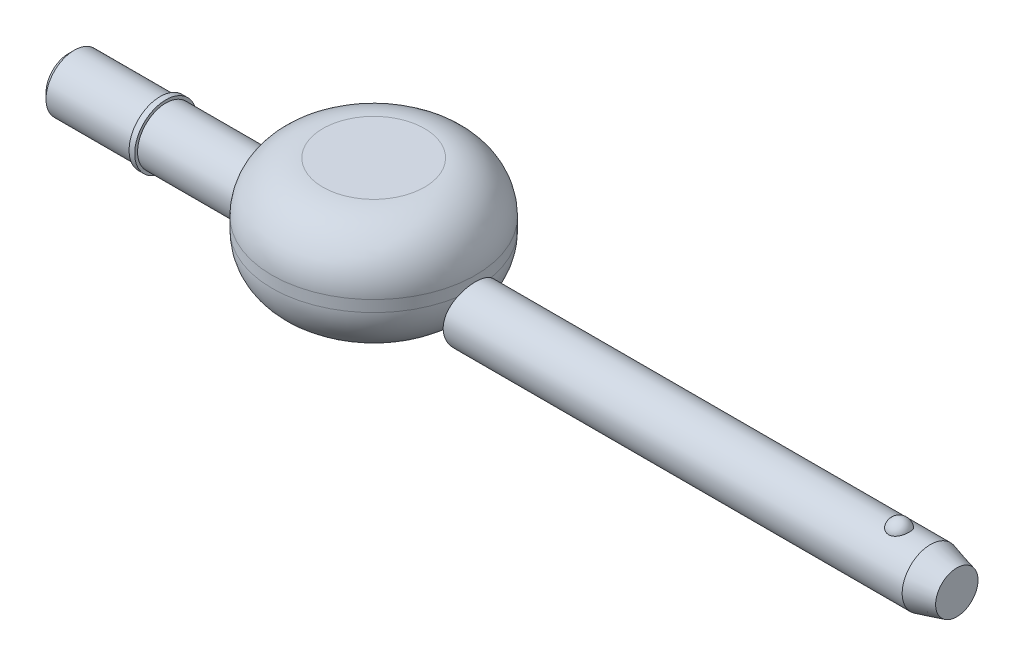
ISO-10303-21;
HEADER;
FILE_DESCRIPTION(('STEP AP214'),'2;1');
FILE_NAME('part.step','',(''),(''),'','','');
FILE_SCHEMA(('AUTOMOTIVE_DESIGN { 1 0 10303 214 1 1 1 1 }'));
ENDSEC;
DATA;
#1=APPLICATION_CONTEXT('core data for automotive mechanical design processes');
#2=APPLICATION_PROTOCOL_DEFINITION('international standard','automotive_design',2000,#1);
#3=PRODUCT_CONTEXT('',#1,'mechanical');
#4=PRODUCT('Part','Part','',(#3));
#5=PRODUCT_RELATED_PRODUCT_CATEGORY('part','',(#4));
#6=PRODUCT_DEFINITION_FORMATION('','',#4);
#7=PRODUCT_DEFINITION_CONTEXT('part definition',#1,'design');
#8=PRODUCT_DEFINITION('design','',#6,#7);
#9=PRODUCT_DEFINITION_SHAPE('','',#8);
#10=(LENGTH_UNIT() NAMED_UNIT(*) SI_UNIT(.MILLI.,.METRE.));
#11=(NAMED_UNIT(*) PLANE_ANGLE_UNIT() SI_UNIT($,.RADIAN.));
#12=(NAMED_UNIT(*) SI_UNIT($,.STERADIAN.) SOLID_ANGLE_UNIT());
#13=UNCERTAINTY_MEASURE_WITH_UNIT(LENGTH_MEASURE(1.E-05),#10,'distance_accuracy_value','');
#14=(GEOMETRIC_REPRESENTATION_CONTEXT(3) GLOBAL_UNCERTAINTY_ASSIGNED_CONTEXT((#13)) GLOBAL_UNIT_ASSIGNED_CONTEXT((#10,
#11,#12)) REPRESENTATION_CONTEXT('',''));
#15=CARTESIAN_POINT('',(0.,0.,0.));
#16=DIRECTION('',(0.,0.,1.));
#17=DIRECTION('',(1.,0.,0.));
#18=AXIS2_PLACEMENT_3D('',#15,#16,#17);
#19=CARTESIAN_POINT('',(85.725,23.81,0.));
#20=DIRECTION('',(0.,-1.,0.));
#21=DIRECTION('',(0.,0.,-1.));
#22=AXIS2_PLACEMENT_3D('',#19,#20,#21);
#23=CYLINDRICAL_SURFACE('',#22,28.575);
#24=CARTESIAN_POINT('',(85.725,6.3475,0.));
#25=DIRECTION('',(0.,1.,0.));
#26=DIRECTION('',(0.,0.,1.));
#27=AXIS2_PLACEMENT_3D('',#24,#25,#26);
#28=CIRCLE('',#27,28.575);
#29=CARTESIAN_POINT('',(85.725,6.3475,28.575));
#30=VERTEX_POINT('',#29);
#31=EDGE_CURVE('P0_E25',#30,#30,#28,.T.);
#32=ORIENTED_EDGE('',*,*,#31,.T.);
#33=EDGE_LOOP('',(#32));
#34=FACE_BOUND('',#33,.T.);
#35=CARTESIAN_POINT('',(85.725,9.5225,0.));
#36=DIRECTION('',(0.,1.,0.));
#37=DIRECTION('',(0.,0.,1.));
#38=AXIS2_PLACEMENT_3D('',#35,#36,#37);
#39=CIRCLE('',#38,28.575);
#40=CARTESIAN_POINT('',(85.725,9.5225,28.575));
#41=VERTEX_POINT('',#40);
#42=EDGE_CURVE('P0_E29',#41,#41,#39,.F.);
#43=ORIENTED_EDGE('',*,*,#42,.T.);
#44=EDGE_LOOP('',(#43));
#45=FACE_BOUND('',#44,.T.);
#46=ADVANCED_FACE('P0_F14',(#34,#45),#23,.T.);
#47=CARTESIAN_POINT('',(85.725,23.81,0.));
#48=DIRECTION('',(0.,1.,0.));
#49=DIRECTION('',(0.,0.,1.));
#50=AXIS2_PLACEMENT_3D('',#47,#48,#49);
#51=PLANE('',#50);
#52=CARTESIAN_POINT('',(85.725,23.81,0.));
#53=DIRECTION('',(0.,1.,0.));
#54=DIRECTION('',(0.,0.,1.));
#55=AXIS2_PLACEMENT_3D('',#52,#53,#54);
#56=CIRCLE('',#55,14.2875);
#57=CARTESIAN_POINT('',(85.725,23.81,14.2875));
#58=VERTEX_POINT('',#57);
#59=EDGE_CURVE('P0_E10',#58,#58,#56,.T.);
#60=ORIENTED_EDGE('',*,*,#59,.T.);
#61=EDGE_LOOP('',(#60));
#62=FACE_BOUND('',#61,.T.);
#63=ADVANCED_FACE('P0_F46',(#62),#51,.T.);
#64=CARTESIAN_POINT('',(85.725,-7.94,0.));
#65=DIRECTION('',(0.,1.,0.));
#66=DIRECTION('',(0.,0.,1.));
#67=AXIS2_PLACEMENT_3D('',#64,#65,#66);
#68=PLANE('',#67);
#69=CARTESIAN_POINT('',(85.725,-7.94,0.));
#70=DIRECTION('',(0.,1.,0.));
#71=DIRECTION('',(0.,0.,1.));
#72=AXIS2_PLACEMENT_3D('',#69,#70,#71);
#73=CIRCLE('',#72,14.2875);
#74=CARTESIAN_POINT('',(85.725,-7.94,14.2875));
#75=VERTEX_POINT('',#74);
#76=EDGE_CURVE('P0_E21',#75,#75,#73,.F.);
#77=ORIENTED_EDGE('',*,*,#76,.T.);
#78=EDGE_LOOP('',(#77));
#79=FACE_BOUND('',#78,.T.);
#80=ADVANCED_FACE('P0_F43',(#79),#68,.F.);
#81=CARTESIAN_POINT('',(85.725,6.3475,0.));
#82=DIRECTION('',(0.,1.,0.));
#83=DIRECTION('',(0.,0.,1.));
#84=AXIS2_PLACEMENT_3D('',#81,#82,#83);
#85=TOROIDAL_SURFACE('',#84,14.2875,14.2875);
#86=ORIENTED_EDGE('',*,*,#76,.F.);
#87=EDGE_LOOP('',(#86));
#88=FACE_BOUND('',#87,.T.);
#89=ORIENTED_EDGE('',*,*,#31,.F.);
#90=EDGE_LOOP('',(#89));
#91=FACE_BOUND('',#90,.T.);
#92=ADVANCED_FACE('P0_F38',(#88,#91),#85,.T.);
#93=CARTESIAN_POINT('',(85.725,9.5225,0.));
#94=DIRECTION('',(0.,1.,0.));
#95=DIRECTION('',(0.,0.,1.));
#96=AXIS2_PLACEMENT_3D('',#93,#94,#95);
#97=TOROIDAL_SURFACE('',#96,14.2875,14.2875);
#98=ORIENTED_EDGE('',*,*,#42,.F.);
#99=EDGE_LOOP('',(#98));
#100=FACE_BOUND('',#99,.T.);
#101=ORIENTED_EDGE('',*,*,#59,.F.);
#102=EDGE_LOOP('',(#101));
#103=FACE_BOUND('',#102,.T.);
#104=ADVANCED_FACE('P0_F16',(#100,#103),#97,.T.);
#105=CLOSED_SHELL('',(#46,#63,#80,#92,#104));
#106=MANIFOLD_SOLID_BREP('P0_B1',#105);
#107=CARTESIAN_POINT('',(0.,0.,0.));
#108=DIRECTION('',(1.,0.,0.));
#109=DIRECTION('',(0.,0.,-1.));
#110=AXIS2_PLACEMENT_3D('',#107,#108,#109);
#111=CYLINDRICAL_SURFACE('',#110,7.94);
#112=CARTESIAN_POINT('',(58.2752818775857,0.,-7.94));
#113=CARTESIAN_POINT('',(58.2752814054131,0.218339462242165,-7.9399993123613));
#114=CARTESIAN_POINT('',(58.2726697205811,0.436691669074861,-7.93098628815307));
#115=CARTESIAN_POINT('',(58.2623027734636,0.871798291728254,-7.89501301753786));
#116=CARTESIAN_POINT('',(58.2545471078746,1.08855258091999,-7.86805136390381));
#117=CARTESIAN_POINT('',(58.2341298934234,1.51892239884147,-7.79641397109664));
#118=CARTESIAN_POINT('',(58.2214673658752,1.73253729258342,-7.75173469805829));
#119=CARTESIAN_POINT('',(58.1916160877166,2.15514620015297,-7.64502850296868));
#120=CARTESIAN_POINT('',(58.1744256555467,2.36413846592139,-7.58299513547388));
#121=CARTESIAN_POINT('',(58.1360696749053,2.77559648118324,-7.44223447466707));
#122=CARTESIAN_POINT('',(58.1149117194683,2.97807384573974,-7.3635390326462));
#123=CARTESIAN_POINT('',(58.0692035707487,3.37565834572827,-7.18996526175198));
#124=CARTESIAN_POINT('',(58.044652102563,3.57076267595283,-7.09508084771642));
#125=CARTESIAN_POINT('',(57.9928646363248,3.9522155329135,-6.88988246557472));
#126=CARTESIAN_POINT('',(57.9656295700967,4.13856706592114,-6.77957384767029));
#127=CARTESIAN_POINT('',(57.9092032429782,4.50152019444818,-6.54421285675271));
#128=CARTESIAN_POINT('',(57.8800110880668,4.678117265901,-6.41915372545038));
#129=CARTESIAN_POINT('',(57.8197338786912,5.02460676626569,-6.15190726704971));
#130=CARTESIAN_POINT('',(57.7886199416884,5.19422795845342,-6.00937467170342));
#131=CARTESIAN_POINT('',(57.7260481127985,5.52086699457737,-5.71074222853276));
#132=CARTESIAN_POINT('',(57.6945903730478,5.67789017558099,-5.55464818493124));
#133=CARTESIAN_POINT('',(57.6321603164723,5.9784820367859,-5.22975661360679));
#134=CARTESIAN_POINT('',(57.6011882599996,6.12204369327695,-5.06095253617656));
#135=CARTESIAN_POINT('',(57.5405992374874,6.39461301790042,-4.71185180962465));
#136=CARTESIAN_POINT('',(57.5109817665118,6.52362613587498,-4.53155950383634));
#137=CARTESIAN_POINT('',(57.4533811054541,6.76844317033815,-4.15724416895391));
#138=CARTESIAN_POINT('',(57.4254367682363,6.88396858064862,-3.96303283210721));
#139=CARTESIAN_POINT('',(57.3725736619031,7.09815651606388,-3.56521914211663));
#140=CARTESIAN_POINT('',(57.3476537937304,7.19682517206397,-3.36162023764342));
#141=CARTESIAN_POINT('',(57.3015387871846,7.37656233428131,-2.94637283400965));
#142=CARTESIAN_POINT('',(57.2803438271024,7.45762999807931,-2.73472395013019));
#143=CARTESIAN_POINT('',(57.2422944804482,7.60146722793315,-2.30491797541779));
#144=CARTESIAN_POINT('',(57.2254399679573,7.66423732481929,-2.08676107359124));
#145=CARTESIAN_POINT('',(57.1969227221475,7.76959948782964,-1.6510340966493));
#146=CARTESIAN_POINT('',(57.1851417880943,7.81265262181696,-1.43358319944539));
#147=CARTESIAN_POINT('',(57.1665098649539,7.88044407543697,-0.995638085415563));
#148=CARTESIAN_POINT('',(57.1596587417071,7.90518289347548,-0.775143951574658));
#149=CARTESIAN_POINT('',(57.1510817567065,7.93611996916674,-0.332792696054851));
#150=CARTESIAN_POINT('',(57.1493551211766,7.94232102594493,-0.110935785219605));
#151=CARTESIAN_POINT('',(57.1510743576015,7.93613326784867,0.332496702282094));
#152=CARTESIAN_POINT('',(57.154520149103,7.92374474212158,0.554072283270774));
#153=CARTESIAN_POINT('',(57.1663200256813,7.88109005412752,0.989182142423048));
#154=CARTESIAN_POINT('',(57.1745361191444,7.85132637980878,1.20276965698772));
#155=CARTESIAN_POINT('',(57.195548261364,7.77457094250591,1.62667072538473));
#156=CARTESIAN_POINT('',(57.2083458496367,7.72757338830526,1.83698315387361));
#157=CARTESIAN_POINT('',(57.238175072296,7.61675869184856,2.25274458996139));
#158=CARTESIAN_POINT('',(57.2552053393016,7.55294698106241,2.45819514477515));
#159=CARTESIAN_POINT('',(57.2930610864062,7.40897748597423,2.86300925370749));
#160=CARTESIAN_POINT('',(57.3138879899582,7.32881356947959,3.06237049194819));
#161=CARTESIAN_POINT('',(57.3590197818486,7.15186675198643,3.45562783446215));
#162=CARTESIAN_POINT('',(57.3833578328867,7.05492339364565,3.64944790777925));
#163=CARTESIAN_POINT('',(57.4347212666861,6.8456652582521,4.02831447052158));
#164=CARTESIAN_POINT('',(57.4617475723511,6.73334519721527,4.21335791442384));
#165=CARTESIAN_POINT('',(57.5177788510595,6.49413702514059,4.57345687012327));
#166=CARTESIAN_POINT('',(57.5467838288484,6.36724887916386,4.74851235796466));
#167=CARTESIAN_POINT('',(57.6060236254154,6.09973907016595,5.08757484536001));
#168=CARTESIAN_POINT('',(57.6362584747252,5.95911706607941,5.25158157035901));
#169=CARTESIAN_POINT('',(57.6981968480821,5.66010309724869,5.5728433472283));
#170=CARTESIAN_POINT('',(57.7299156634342,5.50127397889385,5.72968885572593));
#171=CARTESIAN_POINT('',(57.7929413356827,5.17099027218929,6.0294427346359));
#172=CARTESIAN_POINT('',(57.8242483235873,4.99953981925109,6.17235563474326));
#173=CARTESIAN_POINT('',(57.8855948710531,4.64499130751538,6.44340511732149));
#174=CARTESIAN_POINT('',(57.9156338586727,4.46188808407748,6.57153507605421));
#175=CARTESIAN_POINT('',(57.9735564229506,4.08536156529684,6.81199672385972));
#176=CARTESIAN_POINT('',(58.0014408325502,3.8919423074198,6.92433453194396));
#177=CARTESIAN_POINT('',(58.0544498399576,3.49448106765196,7.13323113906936));
#178=CARTESIAN_POINT('',(58.079551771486,3.2903693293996,7.22966308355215));
#179=CARTESIAN_POINT('',(58.1259709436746,2.87438293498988,7.40489292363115));
#180=CARTESIAN_POINT('',(58.1472896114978,2.66251124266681,7.48369747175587));
#181=CARTESIAN_POINT('',(58.1854824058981,2.23245765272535,7.6230453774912));
#182=CARTESIAN_POINT('',(58.2023566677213,2.01427594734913,7.68358929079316));
#183=CARTESIAN_POINT('',(58.2311160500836,1.57322655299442,7.78587177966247));
#184=CARTESIAN_POINT('',(58.2430013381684,1.35035902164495,7.82761098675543));
#185=CARTESIAN_POINT('',(58.2610949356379,0.908908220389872,7.89085474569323));
#186=CARTESIAN_POINT('',(58.2674742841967,0.690419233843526,7.91296959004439));
#187=CARTESIAN_POINT('',(58.2749964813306,0.252271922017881,7.93902502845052));
#188=CARTESIAN_POINT('',(58.2761394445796,0.0326136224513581,7.94296602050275));
#189=CARTESIAN_POINT('',(58.2731531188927,-0.406213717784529,7.93263862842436));
#190=CARTESIAN_POINT('',(58.2690243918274,-0.625382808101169,7.91837218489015));
#191=CARTESIAN_POINT('',(58.2556252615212,-1.06162955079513,7.8717636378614));
#192=CARTESIAN_POINT('',(58.2463548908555,-1.27870721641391,7.83942164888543));
#193=CARTESIAN_POINT('',(58.2232133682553,-1.70454527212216,7.75784178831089));
#194=CARTESIAN_POINT('',(58.2094456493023,-1.91338409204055,7.70898297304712));
#195=CARTESIAN_POINT('',(58.1776617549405,-2.32619619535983,7.5946231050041));
#196=CARTESIAN_POINT('',(58.1596441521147,-2.53016781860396,7.52911646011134));
#197=CARTESIAN_POINT('',(58.1198836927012,-2.93178218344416,7.38200362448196));
#198=CARTESIAN_POINT('',(58.0981417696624,-3.12942649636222,7.30040146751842));
#199=CARTESIAN_POINT('',(58.051527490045,-3.5172629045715,7.12166218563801));
#200=CARTESIAN_POINT('',(58.0266539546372,-3.70745215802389,7.02451920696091));
#201=CARTESIAN_POINT('',(57.9738518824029,-4.08346058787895,6.81296983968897));
#202=CARTESIAN_POINT('',(57.9458657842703,-4.26907550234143,6.69821473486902));
#203=CARTESIAN_POINT('',(57.8880971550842,-4.63010863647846,6.45393040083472));
#204=CARTESIAN_POINT('',(57.8583140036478,-4.80552329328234,6.32439605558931));
#205=CARTESIAN_POINT('',(57.7977682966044,-5.14501198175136,6.05143715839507));
#206=CARTESIAN_POINT('',(57.7670057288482,-5.30908587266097,5.90801243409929));
#207=CARTESIAN_POINT('',(57.7053225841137,-5.62488081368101,5.60818366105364));
#208=CARTESIAN_POINT('',(57.6744020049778,-5.77660169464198,5.45177943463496));
#209=CARTESIAN_POINT('',(57.6122412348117,-6.07137549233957,5.12176702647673));
#210=CARTESIAN_POINT('',(57.5810223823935,-6.2139967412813,4.94776889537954));
#211=CARTESIAN_POINT('',(57.5201700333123,-6.48403523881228,4.58818327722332));
#212=CARTESIAN_POINT('',(57.4905359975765,-6.61145767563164,4.40259977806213));
#213=CARTESIAN_POINT('',(57.4336614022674,-6.85027548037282,4.02094700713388));
#214=CARTESIAN_POINT('',(57.4064216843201,-6.96166522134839,3.82487408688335));
#215=CARTESIAN_POINT('',(57.3551269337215,-7.16746851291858,3.42371059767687));
#216=CARTESIAN_POINT('',(57.3310706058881,-7.26188897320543,3.21862374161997));
#217=CARTESIAN_POINT('',(57.2869776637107,-7.43241733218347,2.80232011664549));
#218=CARTESIAN_POINT('',(57.2669129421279,-7.50865408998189,2.59115913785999));
#219=CARTESIAN_POINT('',(57.231163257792,-7.64302979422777,2.16287867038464));
#220=CARTESIAN_POINT('',(57.2154766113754,-7.70117569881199,1.9457615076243));
#221=CARTESIAN_POINT('',(57.1889252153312,-7.79889433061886,1.50709659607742));
#222=CARTESIAN_POINT('',(57.1780604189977,-7.83846723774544,1.28554889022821));
#223=CARTESIAN_POINT('',(57.1614695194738,-7.89867642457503,0.83970623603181));
#224=CARTESIAN_POINT('',(57.1557432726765,-7.91931323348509,0.615411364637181));
#225=CARTESIAN_POINT('',(57.1496987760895,-7.94109041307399,0.173291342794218));
#226=CARTESIAN_POINT('',(57.1492069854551,-7.94285642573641,-0.0445008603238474));
#227=CARTESIAN_POINT('',(57.1531948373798,-7.92849756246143,-0.479448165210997));
#228=CARTESIAN_POINT('',(57.1576744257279,-7.91237288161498,-0.696603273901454));
#229=CARTESIAN_POINT('',(57.1714817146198,-7.86237603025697,-1.128690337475));
#230=CARTESIAN_POINT('',(57.180809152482,-7.82850482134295,-1.34362241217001));
#231=CARTESIAN_POINT('',(57.2040574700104,-7.74330777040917,-1.76974435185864));
#232=CARTESIAN_POINT('',(57.2179783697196,-7.69198185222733,-1.98093420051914));
#233=CARTESIAN_POINT('',(57.2499046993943,-7.57279951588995,-2.39637695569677));
#234=CARTESIAN_POINT('',(57.2678754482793,-7.50508311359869,-2.60067274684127));
#235=CARTESIAN_POINT('',(57.3074991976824,-7.3534130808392,-3.00285211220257));
#236=CARTESIAN_POINT('',(57.3291534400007,-7.26945397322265,-3.20073349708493));
#237=CARTESIAN_POINT('',(57.3755762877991,-7.08594912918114,-3.58872905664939));
#238=CARTESIAN_POINT('',(57.4003446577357,-6.98640457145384,-3.77884381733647));
#239=CARTESIAN_POINT('',(57.4523628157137,-6.77242609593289,-4.15015225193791));
#240=CARTESIAN_POINT('',(57.4796127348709,-6.65799139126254,-4.33134545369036));
#241=CARTESIAN_POINT('',(57.5367021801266,-6.41154277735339,-4.68872736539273));
#242=CARTESIAN_POINT('',(57.5665933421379,-6.27912117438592,-4.8646267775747));
#243=CARTESIAN_POINT('',(57.6274665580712,-6.0002394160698,-5.20471796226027));
#244=CARTESIAN_POINT('',(57.6584486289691,-5.85377904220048,-5.3689095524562));
#245=CARTESIAN_POINT('',(57.7206810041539,-5.54772979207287,-5.68459651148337));
#246=CARTESIAN_POINT('',(57.7519313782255,-5.38813740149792,-5.8360884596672));
#247=CARTESIAN_POINT('',(57.813846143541,-5.05687202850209,-6.12535702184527));
#248=CARTESIAN_POINT('',(57.8445105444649,-4.88519924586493,-6.26313386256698));
#249=CARTESIAN_POINT('',(57.9051531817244,-4.52646262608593,-6.52729420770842));
#250=CARTESIAN_POINT('',(57.9350957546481,-4.33912334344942,-6.65331218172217));
#251=CARTESIAN_POINT('',(57.9925914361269,-3.95419443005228,-6.8890391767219));
#252=CARTESIAN_POINT('',(58.0201454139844,-3.75660857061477,-6.99875414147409));
#253=CARTESIAN_POINT('',(58.0720375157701,-3.35252715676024,-7.20105533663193));
#254=CARTESIAN_POINT('',(58.0963766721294,-3.14603449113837,-7.29364706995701));
#255=CARTESIAN_POINT('',(58.1410933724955,-2.72553804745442,-7.46098054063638));
#256=CARTESIAN_POINT('',(58.1614714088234,-2.51153520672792,-7.53572449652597));
#257=CARTESIAN_POINT('',(58.1949855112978,-2.10921964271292,-7.65717226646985));
#258=CARTESIAN_POINT('',(58.2087442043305,-1.92170870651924,-7.70637514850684));
#259=CARTESIAN_POINT('',(58.2325758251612,-1.54337023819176,-7.79096745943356));
#260=CARTESIAN_POINT('',(58.2426490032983,-1.3525429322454,-7.82635782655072));
#261=CARTESIAN_POINT('',(58.2588664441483,-0.968632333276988,-7.88308345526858));
#262=CARTESIAN_POINT('',(58.2650104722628,-0.775548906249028,-7.90441787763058));
#263=CARTESIAN_POINT('',(58.2732177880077,-0.388313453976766,-7.93287432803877));
#264=CARTESIAN_POINT('',(58.2752822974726,-0.194161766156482,-7.94000061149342));
#265=CARTESIAN_POINT('',(58.2752818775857,0.,-7.94));
#266=B_SPLINE_CURVE_WITH_KNOTS('',3,(#112,#113,#114,#115,#116,#117,#118,#119,#120,#121,#122,
#123,#124,#125,#126,#127,#128,#129,#130,#131,#132,#133,#134,#135,#136,#137,#138,#139,#140,#141,
#142,#143,#144,#145,#146,#147,#148,#149,#150,#151,#152,#153,#154,#155,#156,#157,#158,#159,#160,
#161,#162,#163,#164,#165,#166,#167,#168,#169,#170,#171,#172,#173,#174,#175,#176,#177,#178,#179,
#180,#181,#182,#183,#184,#185,#186,#187,#188,#189,#190,#191,#192,#193,#194,#195,#196,#197,#198,
#199,#200,#201,#202,#203,#204,#205,#206,#207,#208,#209,#210,#211,#212,#213,#214,#215,#216,#217,
#218,#219,#220,#221,#222,#223,#224,#225,#226,#227,#228,#229,#230,#231,#232,#233,#234,#235,#236,
#237,#238,#239,#240,#241,#242,#243,#244,#245,#246,#247,#248,#249,#250,#251,#252,#253,#254,#255,
#256,#257,#258,#259,#260,#261,#262,#263,#264,#265),.UNSPECIFIED.,.T.,.F.,(4,2,2,2,2,2,2,2,2,2,2,
2,2,2,2,2,2,2,2,2,2,2,2,2,2,2,2,2,2,2,2,2,2,2,2,2,2,2,2,2,2,2,2,2,2,2,2,2,2,2,2,2,2,2,2,2,2,2,2,
2,2,2,2,2,2,2,2,2,2,2,2,2,2,2,2,2,4),(0.,0.654839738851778,1.30973082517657,1.96475259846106,
2.62001797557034,3.2740418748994,3.92831215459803,4.58235604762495,5.23670077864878,
5.90711827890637,6.57725024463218,7.24772993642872,7.91795762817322,8.60020962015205,
9.28221294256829,9.96424889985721,10.6462650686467,11.3113968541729,11.976510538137,
12.6415237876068,13.3065266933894,13.9531888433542,14.60006849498,15.2467394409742,
15.893653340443,16.547134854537,17.2008414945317,17.8545497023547,18.5082741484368,
19.1838727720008,19.8592510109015,20.5349306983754,21.2103478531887,21.8909153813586,
22.5712256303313,23.2515151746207,23.9317818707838,24.5900658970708,25.2483355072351,
25.90653496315,26.5647302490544,27.2087439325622,27.8529742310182,28.4970432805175,
29.141355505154,29.800640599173,30.460154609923,31.1196768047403,31.779208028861,
32.4598058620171,33.1401706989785,33.8207737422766,34.501099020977,35.1764495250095,
35.8515399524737,36.5266238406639,37.2016888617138,37.8543004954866,38.5069050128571,
39.1594741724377,39.8120461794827,40.4592289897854,41.1066304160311,41.7539829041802,
42.401369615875,43.0671855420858,43.733011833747,44.3990168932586,45.0650109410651,
45.7474571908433,46.4296540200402,47.1116312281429,47.7935236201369,48.376029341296,
48.9584954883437,49.5409964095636,50.1233228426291),.UNSPECIFIED.);
#267=CARTESIAN_POINT('',(58.2752818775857,0.,-7.94));
#268=VERTEX_POINT('',#267);
#269=EDGE_CURVE('P1_E10',#268,#268,#266,.T.);
#270=ORIENTED_EDGE('',*,*,#269,.F.);
#271=EDGE_LOOP('',(#270));
#272=FACE_BOUND('',#271,.T.);
#273=CARTESIAN_POINT('',(27.31,0.,0.));
#274=DIRECTION('',(1.,0.,0.));
#275=DIRECTION('',(0.,0.,-1.));
#276=AXIS2_PLACEMENT_3D('',#273,#274,#275);
#277=CIRCLE('',#276,7.94);
#278=CARTESIAN_POINT('',(27.31,0.,-7.94));
#279=VERTEX_POINT('',#278);
#280=EDGE_CURVE('P1_E19',#279,#279,#277,.T.);
#281=ORIENTED_EDGE('',*,*,#280,.T.);
#282=EDGE_LOOP('',(#281));
#283=FACE_BOUND('',#282,.T.);
#284=ADVANCED_FACE('P1_F14',(#272,#283),#111,.T.);
#285=CARTESIAN_POINT('',(0.,0.,0.));
#286=DIRECTION('',(-1.,0.,0.));
#287=DIRECTION('',(0.,0.,1.));
#288=AXIS2_PLACEMENT_3D('',#285,#286,#287);
#289=PLANE('',#288);
#290=CARTESIAN_POINT('',(0.,0.,0.));
#291=DIRECTION('',(1.,0.,0.));
#292=DIRECTION('',(0.,0.,-1.));
#293=AXIS2_PLACEMENT_3D('',#290,#291,#292);
#294=CIRCLE('',#293,6.352);
#295=CARTESIAN_POINT('',(0.,0.,-6.352));
#296=VERTEX_POINT('',#295);
#297=EDGE_CURVE('P1_E33',#296,#296,#294,.T.);
#298=ORIENTED_EDGE('',*,*,#297,.F.);
#299=EDGE_LOOP('',(#298));
#300=FACE_BOUND('',#299,.T.);
#301=ADVANCED_FACE('P1_F38',(#300),#289,.T.);
#302=CARTESIAN_POINT('',(1.58799999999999,0.,0.));
#303=DIRECTION('',(1.,0.,0.));
#304=DIRECTION('',(0.,0.,-1.));
#305=AXIS2_PLACEMENT_3D('',#302,#303,#304);
#306=CONICAL_SURFACE('',#305,7.94,0.78539816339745);
#307=ORIENTED_EDGE('',*,*,#297,.T.);
#308=EDGE_LOOP('',(#307));
#309=FACE_BOUND('',#308,.T.);
#310=CARTESIAN_POINT('',(1.58799999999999,0.,0.));
#311=DIRECTION('',(1.,0.,0.));
#312=DIRECTION('',(0.,0.,-1.));
#313=AXIS2_PLACEMENT_3D('',#310,#311,#312);
#314=CIRCLE('',#313,7.94);
#315=CARTESIAN_POINT('',(1.58799999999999,0.,-7.94));
#316=VERTEX_POINT('',#315);
#317=EDGE_CURVE('P1_E67',#316,#316,#314,.T.);
#318=ORIENTED_EDGE('',*,*,#317,.F.);
#319=EDGE_LOOP('',(#318));
#320=FACE_BOUND('',#319,.T.);
#321=ADVANCED_FACE('P1_F55',(#309,#320),#306,.T.);
#322=CARTESIAN_POINT('',(0.,0.,0.));
#323=DIRECTION('',(1.,0.,0.));
#324=DIRECTION('',(0.,0.,-1.));
#325=AXIS2_PLACEMENT_3D('',#322,#323,#324);
#326=CYLINDRICAL_SURFACE('',#325,7.94);
#327=ORIENTED_EDGE('',*,*,#317,.T.);
#328=EDGE_LOOP('',(#327));
#329=FACE_BOUND('',#328,.T.);
#330=CARTESIAN_POINT('',(25.722,0.,0.));
#331=DIRECTION('',(1.,0.,0.));
#332=DIRECTION('',(0.,0.,-1.));
#333=AXIS2_PLACEMENT_3D('',#330,#331,#332);
#334=CIRCLE('',#333,7.94);
#335=CARTESIAN_POINT('',(25.722,0.,-7.94));
#336=VERTEX_POINT('',#335);
#337=EDGE_CURVE('P1_E69',#336,#336,#334,.T.);
#338=ORIENTED_EDGE('',*,*,#337,.F.);
#339=EDGE_LOOP('',(#338));
#340=FACE_BOUND('',#339,.T.);
#341=ADVANCED_FACE('P1_F51',(#329,#340),#326,.T.);
#342=CARTESIAN_POINT('',(25.722,7.94,0.));
#343=DIRECTION('',(-1.,0.,0.));
#344=DIRECTION('',(0.,0.,1.));
#345=AXIS2_PLACEMENT_3D('',#342,#343,#344);
#346=PLANE('',#345);
#347=ORIENTED_EDGE('',*,*,#337,.T.);
#348=EDGE_LOOP('',(#347));
#349=FACE_BOUND('',#348,.T.);
#350=CARTESIAN_POINT('',(25.722,0.,0.));
#351=DIRECTION('',(1.,0.,0.));
#352=DIRECTION('',(0.,0.,-1.));
#353=AXIS2_PLACEMENT_3D('',#350,#351,#352);
#354=CIRCLE('',#353,8.734);
#355=CARTESIAN_POINT('',(25.722,0.,-8.734));
#356=VERTEX_POINT('',#355);
#357=EDGE_CURVE('P1_E28',#356,#356,#354,.T.);
#358=ORIENTED_EDGE('',*,*,#357,.F.);
#359=EDGE_LOOP('',(#358));
#360=FACE_BOUND('',#359,.T.);
#361=ADVANCED_FACE('P1_F47',(#349,#360),#346,.T.);
#362=CARTESIAN_POINT('',(0.,0.,0.));
#363=DIRECTION('',(1.,0.,0.));
#364=DIRECTION('',(0.,0.,-1.));
#365=AXIS2_PLACEMENT_3D('',#362,#363,#364);
#366=CYLINDRICAL_SURFACE('',#365,8.734);
#367=ORIENTED_EDGE('',*,*,#357,.T.);
#368=EDGE_LOOP('',(#367));
#369=FACE_BOUND('',#368,.T.);
#370=CARTESIAN_POINT('',(27.31,0.,0.));
#371=DIRECTION('',(1.,0.,0.));
#372=DIRECTION('',(0.,0.,-1.));
#373=AXIS2_PLACEMENT_3D('',#370,#371,#372);
#374=CIRCLE('',#373,8.734);
#375=CARTESIAN_POINT('',(27.31,0.,-8.734));
#376=VERTEX_POINT('',#375);
#377=EDGE_CURVE('P1_E23',#376,#376,#374,.T.);
#378=ORIENTED_EDGE('',*,*,#377,.F.);
#379=EDGE_LOOP('',(#378));
#380=FACE_BOUND('',#379,.T.);
#381=ADVANCED_FACE('P1_F43',(#369,#380),#366,.T.);
#382=CARTESIAN_POINT('',(27.31,8.734,0.));
#383=DIRECTION('',(1.,0.,0.));
#384=DIRECTION('',(0.,0.,-1.));
#385=AXIS2_PLACEMENT_3D('',#382,#383,#384);
#386=PLANE('',#385);
#387=ORIENTED_EDGE('',*,*,#377,.T.);
#388=EDGE_LOOP('',(#387));
#389=FACE_BOUND('',#388,.T.);
#390=ORIENTED_EDGE('',*,*,#280,.F.);
#391=EDGE_LOOP('',(#390));
#392=FACE_BOUND('',#391,.T.);
#393=ADVANCED_FACE('P1_F40',(#389,#392),#386,.T.);
#394=CARTESIAN_POINT('',(85.725,-8.734,0.));
#395=DIRECTION('',(0.,1.,0.));
#396=DIRECTION('',(0.,0.,1.));
#397=AXIS2_PLACEMENT_3D('',#394,#395,#396);
#398=CYLINDRICAL_SURFACE('',#397,28.575);
#399=ORIENTED_EDGE('',*,*,#269,.T.);
#400=EDGE_LOOP('',(#399));
#401=FACE_BOUND('',#400,.T.);
#402=ADVANCED_FACE('P1_F16',(#401),#398,.F.);
#403=CLOSED_SHELL('',(#284,#301,#321,#341,#361,#381,#393,#402));
#404=MANIFOLD_SOLID_BREP('P1_B1',#403);
#405=CARTESIAN_POINT('',(249.56,5.95500000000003,0.));
#406=DIRECTION('',(1.,0.,0.));
#407=DIRECTION('',(0.,0.,-1.));
#408=AXIS2_PLACEMENT_3D('',#405,#406,#407);
#409=PLANE('',#408);
#410=CARTESIAN_POINT('',(249.56,0.,0.));
#411=DIRECTION('',(1.,0.,0.));
#412=DIRECTION('',(0.,0.,-1.));
#413=AXIS2_PLACEMENT_3D('',#410,#411,#412);
#414=CIRCLE('',#413,5.95500000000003);
#415=CARTESIAN_POINT('',(249.56,0.,-5.95500000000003));
#416=VERTEX_POINT('',#415);
#417=EDGE_CURVE('P2_E26',#416,#416,#414,.T.);
#418=ORIENTED_EDGE('',*,*,#417,.T.);
#419=EDGE_LOOP('',(#418));
#420=FACE_BOUND('',#419,.T.);
#421=ADVANCED_FACE('P2_F13',(#420),#409,.T.);
#422=CARTESIAN_POINT('',(233.344907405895,7.146,0.));
#423=DIRECTION('',(-1.,0.,0.));
#424=DIRECTION('',(0.,-1.,0.));
#425=AXIS2_PLACEMENT_3D('',#422,#423,#424);
#426=SPHERICAL_SURFACE('',#425,2.94400000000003);
#427=CARTESIAN_POINT('',(233.344907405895,7.37767842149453,2.93486986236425));
#428=CARTESIAN_POINT('',(233.192749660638,7.37767329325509,2.93487505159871));
#429=CARTESIAN_POINT('',(233.040632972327,7.38258419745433,2.92262454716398));
#430=CARTESIAN_POINT('',(232.740928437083,7.40163229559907,2.87404196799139));
#431=CARTESIAN_POINT('',(232.593339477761,7.41576720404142,2.83771585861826));
#432=CARTESIAN_POINT('',(232.307018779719,7.45161576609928,2.74218769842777));
#433=CARTESIAN_POINT('',(232.168274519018,7.47331841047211,2.68301886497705));
#434=CARTESIAN_POINT('',(231.902882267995,7.52194082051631,2.54350967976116));
#435=CARTESIAN_POINT('',(231.776236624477,7.54886159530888,2.463165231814));
#436=CARTESIAN_POINT('',(231.534534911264,7.60594671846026,2.28090375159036));
#437=CARTESIAN_POINT('',(231.419906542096,7.63618114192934,2.17844211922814));
#438=CARTESIAN_POINT('',(231.208878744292,7.6961404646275,1.956084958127));
#439=CARTESIAN_POINT('',(231.112482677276,7.72586526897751,1.8361862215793));
#440=CARTESIAN_POINT('',(230.935938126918,7.78314821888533,1.5762808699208));
#441=CARTESIAN_POINT('',(230.856707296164,7.81055035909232,1.43561546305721));
#442=CARTESIAN_POINT('',(230.721797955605,7.85879631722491,1.14236334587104));
#443=CARTESIAN_POINT('',(230.666121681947,7.87963951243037,0.989775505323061));
#444=CARTESIAN_POINT('',(230.57881215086,7.91289645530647,0.674619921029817));
#445=CARTESIAN_POINT('',(230.54753090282,7.92518652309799,0.511941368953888));
#446=CARTESIAN_POINT('',(230.510975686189,7.93958930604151,0.183247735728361));
#447=CARTESIAN_POINT('',(230.505701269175,7.94170219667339,0.0172327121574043));
#448=CARTESIAN_POINT('',(230.521231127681,7.93554931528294,-0.312672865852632));
#449=CARTESIAN_POINT('',(230.541925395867,7.92732732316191,-0.476569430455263));
#450=CARTESIAN_POINT('',(230.60878655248,7.90141534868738,-0.7983052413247));
#451=CARTESIAN_POINT('',(230.654953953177,7.88372517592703,-0.956144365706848));
#452=CARTESIAN_POINT('',(230.771898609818,7.84066230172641,-1.26152073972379));
#453=CARTESIAN_POINT('',(230.842704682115,7.81528060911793,-1.40904568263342));
#454=CARTESIAN_POINT('',(231.007478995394,7.75948672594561,-1.68950598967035));
#455=CARTESIAN_POINT('',(231.101448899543,7.72907417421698,-1.82244030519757));
#456=CARTESIAN_POINT('',(231.310839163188,7.66640424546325,-2.07032792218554));
#457=CARTESIAN_POINT('',(231.426315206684,7.63414223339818,-2.1852330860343));
#458=CARTESIAN_POINT('',(231.6759006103,7.57149681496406,-2.39329737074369));
#459=CARTESIAN_POINT('',(231.810008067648,7.54111321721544,-2.48645870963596));
#460=CARTESIAN_POINT('',(232.090111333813,7.48650742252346,-2.64628132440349));
#461=CARTESIAN_POINT('',(232.235760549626,7.46215900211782,-2.71350554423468));
#462=CARTESIAN_POINT('',(232.537425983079,7.42171253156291,-2.82226614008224));
#463=CARTESIAN_POINT('',(232.693438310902,7.40561140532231,-2.86381209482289));
#464=CARTESIAN_POINT('',(233.002970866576,7.38426796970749,-2.91839077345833));
#465=CARTESIAN_POINT('',(233.156222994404,7.37852109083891,-2.93275024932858));
#466=CARTESIAN_POINT('',(233.463070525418,7.37700973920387,-2.93655208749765));
#467=CARTESIAN_POINT('',(233.616665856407,7.38124333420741,-2.925999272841));
#468=CARTESIAN_POINT('',(233.914990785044,7.39890635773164,-2.88102897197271));
#469=CARTESIAN_POINT('',(234.059848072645,7.41205491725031,-2.84733999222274));
#470=CARTESIAN_POINT('',(234.34164329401,7.44580110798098,-2.75788206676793));
#471=CARTESIAN_POINT('',(234.478580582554,7.46639934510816,-2.70211132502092));
#472=CARTESIAN_POINT('',(234.744061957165,7.51339098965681,-2.56858908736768));
#473=CARTESIAN_POINT('',(234.872354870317,7.5399020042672,-2.49038067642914));
#474=CARTESIAN_POINT('',(235.114244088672,7.59569503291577,-2.31462737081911));
#475=CARTESIAN_POINT('',(235.227837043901,7.62497767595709,-2.21707808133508));
#476=CARTESIAN_POINT('',(235.44322156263,7.68489473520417,-1.99982049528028));
#477=CARTESIAN_POINT('',(235.544148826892,7.7155241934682,-1.8792533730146));
#478=CARTESIAN_POINT('',(235.725186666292,7.77353016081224,-1.62268826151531));
#479=CARTESIAN_POINT('',(235.805293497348,7.80090608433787,-1.48668750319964));
#480=CARTESIAN_POINT('',(235.945361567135,7.85047992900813,-1.19818413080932));
#481=CARTESIAN_POINT('',(236.004587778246,7.87248183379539,-1.04529016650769));
#482=CARTESIAN_POINT('',(236.097982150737,7.90785114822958,-0.731080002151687));
#483=CARTESIAN_POINT('',(236.132149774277,7.92121837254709,-0.569763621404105));
#484=CARTESIAN_POINT('',(236.174795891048,7.93797834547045,-0.242812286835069));
#485=CARTESIAN_POINT('',(236.183204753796,7.94134405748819,-0.0771668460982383));
#486=CARTESIAN_POINT('',(236.173962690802,7.93767937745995,0.253276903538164));
#487=CARTESIAN_POINT('',(236.156312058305,7.93064910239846,0.418075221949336));
#488=CARTESIAN_POINT('',(236.095424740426,7.90695571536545,0.741525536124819));
#489=CARTESIAN_POINT('',(236.052281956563,7.8903279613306,0.900197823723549));
#490=CARTESIAN_POINT('',(235.94135358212,7.84916386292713,1.20759654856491));
#491=CARTESIAN_POINT('',(235.87356656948,7.82462706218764,1.35632241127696));
#492=CARTESIAN_POINT('',(235.714371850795,7.77006699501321,1.64032869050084));
#493=CARTESIAN_POINT('',(235.622861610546,7.74002008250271,1.7755471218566));
#494=CARTESIAN_POINT('',(235.418296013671,7.67774175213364,2.0280064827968));
#495=CARTESIAN_POINT('',(235.305241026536,7.64551037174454,2.14524772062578));
#496=CARTESIAN_POINT('',(235.060831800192,7.58265895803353,2.35778002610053));
#497=CARTESIAN_POINT('',(234.929583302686,7.5520309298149,2.45319004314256));
#498=CARTESIAN_POINT('',(234.651601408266,7.49579792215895,2.61999897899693));
#499=CARTESIAN_POINT('',(234.504867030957,7.47019326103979,2.69139637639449));
#500=CARTESIAN_POINT('',(234.192947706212,7.42622216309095,2.81053241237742));
#501=CARTESIAN_POINT('',(234.027220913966,7.40825002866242,2.85700910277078));
#502=CARTESIAN_POINT('',(233.689279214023,7.38398348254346,2.91916850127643));
#503=CARTESIAN_POINT('',(233.51706702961,7.37768422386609,2.93486399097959));
#504=CARTESIAN_POINT('',(233.344907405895,7.37767842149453,2.93486986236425));
#505=B_SPLINE_CURVE_WITH_KNOTS('',3,(#427,#428,#429,#430,#431,#432,#433,#434,#435,#436,#437,
#438,#439,#440,#441,#442,#443,#444,#445,#446,#447,#448,#449,#450,#451,#452,#453,#454,#455,#456,
#457,#458,#459,#460,#461,#462,#463,#464,#465,#466,#467,#468,#469,#470,#471,#472,#473,#474,#475,
#476,#477,#478,#479,#480,#481,#482,#483,#484,#485,#486,#487,#488,#489,#490,#491,#492,#493,#494,
#495,#496,#497,#498,#499,#500,#501,#502,#503,#504),.UNSPECIFIED.,.T.,.F.,(4,2,2,2,2,2,2,2,2,2,2,
2,2,2,2,2,2,2,2,2,2,2,2,2,2,2,2,2,2,2,2,2,2,2,2,2,2,2,4),(0.,0.455841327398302,
0.911569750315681,1.36663794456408,1.82179423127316,2.28978983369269,2.75787163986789,
3.24685368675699,3.73588214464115,4.23184282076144,4.7277949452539,5.22165321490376,
5.71552141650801,6.20996917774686,6.70445245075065,7.20023431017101,7.69596557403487,
8.1802341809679,8.6643220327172,9.12410697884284,9.58380291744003,10.0296503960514,
10.475534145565,10.9312349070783,11.3870393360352,11.8654416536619,12.3439299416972,
12.8378875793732,13.3318558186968,13.8271581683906,14.3224549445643,14.8159385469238,
15.3094506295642,15.8051323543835,16.3008055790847,16.7937101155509,17.2866458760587,
17.8026240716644,18.3183879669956),.UNSPECIFIED.);
#506=CARTESIAN_POINT('',(233.344907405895,7.37767842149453,2.93486986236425));
#507=VERTEX_POINT('',#506);
#508=EDGE_CURVE('P2_E31',#507,#507,#505,.T.);
#509=ORIENTED_EDGE('',*,*,#508,.F.);
#510=EDGE_LOOP('',(#509));
#511=FACE_BOUND('',#510,.T.);
#512=ADVANCED_FACE('P2_F38',(#511),#426,.T.);
#513=CARTESIAN_POINT('',(249.56,0.,0.));
#514=DIRECTION('',(-1.,0.,0.));
#515=DIRECTION('',(0.,0.,1.));
#516=AXIS2_PLACEMENT_3D('',#513,#514,#515);
#517=CONICAL_SURFACE('',#516,5.95500000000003,0.26179938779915);
#518=CARTESIAN_POINT('',(242.151879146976,0.,0.));
#519=DIRECTION('',(1.,0.,0.));
#520=DIRECTION('',(0.,0.,-1.));
#521=AXIS2_PLACEMENT_3D('',#518,#519,#520);
#522=CIRCLE('',#521,7.94);
#523=CARTESIAN_POINT('',(242.151879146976,0.,-7.94));
#524=VERTEX_POINT('',#523);
#525=EDGE_CURVE('P2_E9',#524,#524,#522,.T.);
#526=ORIENTED_EDGE('',*,*,#525,.T.);
#527=EDGE_LOOP('',(#526));
#528=FACE_BOUND('',#527,.T.);
#529=ORIENTED_EDGE('',*,*,#417,.F.);
#530=EDGE_LOOP('',(#529));
#531=FACE_BOUND('',#530,.T.);
#532=ADVANCED_FACE('P2_F42',(#528,#531),#517,.T.);
#533=CARTESIAN_POINT('',(0.,0.,0.));
#534=DIRECTION('',(1.,0.,0.));
#535=DIRECTION('',(0.,0.,-1.));
#536=AXIS2_PLACEMENT_3D('',#533,#534,#535);
#537=CYLINDRICAL_SURFACE('',#536,7.94);
#538=CARTESIAN_POINT('',(113.174718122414,0.,-7.94));
#539=CARTESIAN_POINT('',(113.174718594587,-0.218339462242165,-7.9399993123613));
#540=CARTESIAN_POINT('',(113.177330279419,-0.43669166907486,-7.93098628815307));
#541=CARTESIAN_POINT('',(113.187697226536,-0.871798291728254,-7.89501301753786));
#542=CARTESIAN_POINT('',(113.195452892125,-1.08855258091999,-7.86805136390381));
#543=CARTESIAN_POINT('',(113.215870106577,-1.51892239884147,-7.79641397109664));
#544=CARTESIAN_POINT('',(113.228532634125,-1.73253729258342,-7.75173469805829));
#545=CARTESIAN_POINT('',(113.258383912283,-2.15514620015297,-7.64502850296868));
#546=CARTESIAN_POINT('',(113.275574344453,-2.36413846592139,-7.58299513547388));
#547=CARTESIAN_POINT('',(113.313930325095,-2.77559648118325,-7.44223447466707));
#548=CARTESIAN_POINT('',(113.335088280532,-2.97807384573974,-7.3635390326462));
#549=CARTESIAN_POINT('',(113.380796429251,-3.37565834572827,-7.18996526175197));
#550=CARTESIAN_POINT('',(113.405347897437,-3.57076267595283,-7.09508084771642));
#551=CARTESIAN_POINT('',(113.457135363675,-3.9522155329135,-6.88988246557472));
#552=CARTESIAN_POINT('',(113.484370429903,-4.13856706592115,-6.77957384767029));
#553=CARTESIAN_POINT('',(113.540796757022,-4.50152019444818,-6.54421285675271));
#554=CARTESIAN_POINT('',(113.569988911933,-4.678117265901,-6.41915372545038));
#555=CARTESIAN_POINT('',(113.630266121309,-5.0246067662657,-6.15190726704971));
#556=CARTESIAN_POINT('',(113.661380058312,-5.19422795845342,-6.00937467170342));
#557=CARTESIAN_POINT('',(113.723951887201,-5.52086699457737,-5.71074222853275));
#558=CARTESIAN_POINT('',(113.755409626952,-5.67789017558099,-5.55464818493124));
#559=CARTESIAN_POINT('',(113.817839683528,-5.9784820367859,-5.22975661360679));
#560=CARTESIAN_POINT('',(113.84881174,-6.12204369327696,-5.06095253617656));
#561=CARTESIAN_POINT('',(113.909400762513,-6.39461301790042,-4.71185180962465));
#562=CARTESIAN_POINT('',(113.939018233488,-6.52362613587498,-4.53155950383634));
#563=CARTESIAN_POINT('',(113.996618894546,-6.76844317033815,-4.15724416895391));
#564=CARTESIAN_POINT('',(114.024563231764,-6.88396858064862,-3.96303283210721));
#565=CARTESIAN_POINT('',(114.077426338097,-7.09815651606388,-3.56521914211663));
#566=CARTESIAN_POINT('',(114.10234620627,-7.19682517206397,-3.36162023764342));
#567=CARTESIAN_POINT('',(114.148461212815,-7.37656233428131,-2.94637283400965));
#568=CARTESIAN_POINT('',(114.169656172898,-7.45762999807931,-2.73472395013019));
#569=CARTESIAN_POINT('',(114.207705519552,-7.60146722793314,-2.30491797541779));
#570=CARTESIAN_POINT('',(114.224560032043,-7.66423732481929,-2.08676107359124));
#571=CARTESIAN_POINT('',(114.253077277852,-7.76959948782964,-1.65103409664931));
#572=CARTESIAN_POINT('',(114.264858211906,-7.81265262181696,-1.43358319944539));
#573=CARTESIAN_POINT('',(114.283490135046,-7.88044407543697,-0.995638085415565));
#574=CARTESIAN_POINT('',(114.290341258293,-7.90518289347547,-0.775143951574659));
#575=CARTESIAN_POINT('',(114.298918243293,-7.93611996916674,-0.332792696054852));
#576=CARTESIAN_POINT('',(114.300644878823,-7.94232102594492,-0.110935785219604));
#577=CARTESIAN_POINT('',(114.298925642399,-7.93613326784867,0.332496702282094));
#578=CARTESIAN_POINT('',(114.295479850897,-7.92374474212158,0.554072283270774));
#579=CARTESIAN_POINT('',(114.283679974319,-7.88109005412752,0.989182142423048));
#580=CARTESIAN_POINT('',(114.275463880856,-7.85132637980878,1.20276965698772));
#581=CARTESIAN_POINT('',(114.254451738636,-7.77457094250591,1.62667072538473));
#582=CARTESIAN_POINT('',(114.241654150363,-7.72757338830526,1.83698315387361));
#583=CARTESIAN_POINT('',(114.211824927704,-7.61675869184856,2.25274458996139));
#584=CARTESIAN_POINT('',(114.194794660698,-7.55294698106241,2.45819514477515));
#585=CARTESIAN_POINT('',(114.156938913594,-7.40897748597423,2.8630092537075));
#586=CARTESIAN_POINT('',(114.136112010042,-7.32881356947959,3.06237049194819));
#587=CARTESIAN_POINT('',(114.090980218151,-7.15186675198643,3.45562783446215));
#588=CARTESIAN_POINT('',(114.066642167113,-7.05492339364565,3.64944790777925));
#589=CARTESIAN_POINT('',(114.015278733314,-6.8456652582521,4.02831447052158));
#590=CARTESIAN_POINT('',(113.988252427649,-6.73334519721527,4.21335791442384));
#591=CARTESIAN_POINT('',(113.93222114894,-6.49413702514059,4.57345687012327));
#592=CARTESIAN_POINT('',(113.903216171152,-6.36724887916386,4.74851235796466));
#593=CARTESIAN_POINT('',(113.843976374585,-6.09973907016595,5.08757484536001));
#594=CARTESIAN_POINT('',(113.813741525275,-5.95911706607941,5.25158157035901));
#595=CARTESIAN_POINT('',(113.751803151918,-5.66010309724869,5.5728433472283));
#596=CARTESIAN_POINT('',(113.720084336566,-5.50127397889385,5.72968885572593));
#597=CARTESIAN_POINT('',(113.657058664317,-5.17099027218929,6.0294427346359));
#598=CARTESIAN_POINT('',(113.625751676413,-4.99953981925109,6.17235563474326));
#599=CARTESIAN_POINT('',(113.564405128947,-4.64499130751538,6.4434051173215));
#600=CARTESIAN_POINT('',(113.534366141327,-4.46188808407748,6.57153507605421));
#601=CARTESIAN_POINT('',(113.476443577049,-4.08536156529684,6.81199672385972));
#602=CARTESIAN_POINT('',(113.44855916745,-3.8919423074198,6.92433453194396));
#603=CARTESIAN_POINT('',(113.395550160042,-3.49448106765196,7.13323113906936));
#604=CARTESIAN_POINT('',(113.370448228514,-3.2903693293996,7.22966308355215));
#605=CARTESIAN_POINT('',(113.324029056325,-2.87438293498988,7.40489292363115));
#606=CARTESIAN_POINT('',(113.302710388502,-2.66251124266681,7.48369747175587));
#607=CARTESIAN_POINT('',(113.264517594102,-2.23245765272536,7.62304537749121));
#608=CARTESIAN_POINT('',(113.247643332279,-2.01427594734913,7.68358929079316));
#609=CARTESIAN_POINT('',(113.218883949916,-1.57322655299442,7.78587177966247));
#610=CARTESIAN_POINT('',(113.206998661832,-1.35035902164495,7.82761098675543));
#611=CARTESIAN_POINT('',(113.188905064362,-0.90890822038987,7.89085474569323));
#612=CARTESIAN_POINT('',(113.182525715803,-0.690419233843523,7.91296959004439));
#613=CARTESIAN_POINT('',(113.175003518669,-0.252271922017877,7.93902502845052));
#614=CARTESIAN_POINT('',(113.17386055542,-0.0326136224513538,7.94296602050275));
#615=CARTESIAN_POINT('',(113.176846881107,0.406213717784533,7.93263862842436));
#616=CARTESIAN_POINT('',(113.180975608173,0.625382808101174,7.91837218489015));
#617=CARTESIAN_POINT('',(113.194374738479,1.06162955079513,7.87176363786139));
#618=CARTESIAN_POINT('',(113.203645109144,1.27870721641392,7.83942164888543));
#619=CARTESIAN_POINT('',(113.226786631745,1.70454527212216,7.75784178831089));
#620=CARTESIAN_POINT('',(113.240554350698,1.91338409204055,7.70898297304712));
#621=CARTESIAN_POINT('',(113.27233824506,2.32619619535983,7.5946231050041));
#622=CARTESIAN_POINT('',(113.290355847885,2.53016781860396,7.52911646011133));
#623=CARTESIAN_POINT('',(113.330116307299,2.93178218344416,7.38200362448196));
#624=CARTESIAN_POINT('',(113.351858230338,3.12942649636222,7.30040146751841));
#625=CARTESIAN_POINT('',(113.398472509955,3.5172629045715,7.12166218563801));
#626=CARTESIAN_POINT('',(113.423346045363,3.70745215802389,7.02451920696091));
#627=CARTESIAN_POINT('',(113.476148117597,4.08346058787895,6.81296983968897));
#628=CARTESIAN_POINT('',(113.50413421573,4.26907550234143,6.69821473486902));
#629=CARTESIAN_POINT('',(113.561902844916,4.63010863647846,6.45393040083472));
#630=CARTESIAN_POINT('',(113.591685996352,4.80552329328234,6.32439605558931));
#631=CARTESIAN_POINT('',(113.652231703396,5.14501198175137,6.05143715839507));
#632=CARTESIAN_POINT('',(113.682994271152,5.30908587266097,5.90801243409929));
#633=CARTESIAN_POINT('',(113.744677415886,5.62488081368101,5.60818366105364));
#634=CARTESIAN_POINT('',(113.775597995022,5.77660169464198,5.45177943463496));
#635=CARTESIAN_POINT('',(113.837758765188,6.07137549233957,5.12176702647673));
#636=CARTESIAN_POINT('',(113.868977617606,6.2139967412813,4.94776889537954));
#637=CARTESIAN_POINT('',(113.929829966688,6.48403523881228,4.58818327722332));
#638=CARTESIAN_POINT('',(113.959464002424,6.61145767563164,4.40259977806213));
#639=CARTESIAN_POINT('',(114.016338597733,6.85027548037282,4.02094700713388));
#640=CARTESIAN_POINT('',(114.04357831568,6.96166522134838,3.82487408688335));
#641=CARTESIAN_POINT('',(114.094873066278,7.16746851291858,3.42371059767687));
#642=CARTESIAN_POINT('',(114.118929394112,7.26188897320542,3.21862374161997));
#643=CARTESIAN_POINT('',(114.163022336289,7.43241733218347,2.80232011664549));
#644=CARTESIAN_POINT('',(114.183087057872,7.50865408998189,2.59115913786));
#645=CARTESIAN_POINT('',(114.218836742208,7.64302979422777,2.16287867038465));
#646=CARTESIAN_POINT('',(114.234523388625,7.70117569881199,1.9457615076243));
#647=CARTESIAN_POINT('',(114.261074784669,7.79889433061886,1.50709659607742));
#648=CARTESIAN_POINT('',(114.271939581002,7.83846723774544,1.28554889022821));
#649=CARTESIAN_POINT('',(114.288530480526,7.89867642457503,0.839706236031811));
#650=CARTESIAN_POINT('',(114.294256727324,7.91931323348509,0.615411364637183));
#651=CARTESIAN_POINT('',(114.30030122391,7.94109041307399,0.173291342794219));
#652=CARTESIAN_POINT('',(114.300793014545,7.94285642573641,-0.0445008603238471));
#653=CARTESIAN_POINT('',(114.29680516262,7.92849756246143,-0.479448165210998));
#654=CARTESIAN_POINT('',(114.292325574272,7.91237288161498,-0.696603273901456));
#655=CARTESIAN_POINT('',(114.27851828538,7.86237603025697,-1.128690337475));
#656=CARTESIAN_POINT('',(114.269190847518,7.82850482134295,-1.34362241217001));
#657=CARTESIAN_POINT('',(114.24594252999,7.74330777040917,-1.76974435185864));
#658=CARTESIAN_POINT('',(114.23202163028,7.69198185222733,-1.98093420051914));
#659=CARTESIAN_POINT('',(114.200095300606,7.57279951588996,-2.39637695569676));
#660=CARTESIAN_POINT('',(114.182124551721,7.50508311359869,-2.60067274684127));
#661=CARTESIAN_POINT('',(114.142500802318,7.3534130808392,-3.00285211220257));
#662=CARTESIAN_POINT('',(114.120846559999,7.26945397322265,-3.20073349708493));
#663=CARTESIAN_POINT('',(114.074423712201,7.08594912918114,-3.58872905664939));
#664=CARTESIAN_POINT('',(114.049655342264,6.98640457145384,-3.77884381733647));
#665=CARTESIAN_POINT('',(113.997637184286,6.77242609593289,-4.15015225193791));
#666=CARTESIAN_POINT('',(113.970387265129,6.65799139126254,-4.33134545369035));
#667=CARTESIAN_POINT('',(113.913297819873,6.41154277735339,-4.68872736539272));
#668=CARTESIAN_POINT('',(113.883406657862,6.27912117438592,-4.8646267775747));
#669=CARTESIAN_POINT('',(113.822533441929,6.0002394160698,-5.20471796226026));
#670=CARTESIAN_POINT('',(113.791551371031,5.85377904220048,-5.3689095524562));
#671=CARTESIAN_POINT('',(113.729318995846,5.54772979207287,-5.68459651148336));
#672=CARTESIAN_POINT('',(113.698068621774,5.38813740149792,-5.83608845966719));
#673=CARTESIAN_POINT('',(113.636153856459,5.05687202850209,-6.12535702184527));
#674=CARTESIAN_POINT('',(113.605489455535,4.88519924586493,-6.26313386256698));
#675=CARTESIAN_POINT('',(113.544846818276,4.52646262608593,-6.52729420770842));
#676=CARTESIAN_POINT('',(113.514904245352,4.33912334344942,-6.65331218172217));
#677=CARTESIAN_POINT('',(113.457408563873,3.95419443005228,-6.8890391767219));
#678=CARTESIAN_POINT('',(113.429854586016,3.75660857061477,-6.99875414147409));
#679=CARTESIAN_POINT('',(113.37796248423,3.35252715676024,-7.20105533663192));
#680=CARTESIAN_POINT('',(113.353623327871,3.14603449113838,-7.293647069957));
#681=CARTESIAN_POINT('',(113.308906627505,2.72553804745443,-7.46098054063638));
#682=CARTESIAN_POINT('',(113.288528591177,2.51153520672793,-7.53572449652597));
#683=CARTESIAN_POINT('',(113.255014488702,2.10921964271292,-7.65717226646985));
#684=CARTESIAN_POINT('',(113.24125579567,1.92170870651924,-7.70637514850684));
#685=CARTESIAN_POINT('',(113.217424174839,1.54337023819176,-7.79096745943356));
#686=CARTESIAN_POINT('',(113.207350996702,1.3525429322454,-7.82635782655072));
#687=CARTESIAN_POINT('',(113.191133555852,0.968632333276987,-7.88308345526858));
#688=CARTESIAN_POINT('',(113.184989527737,0.775548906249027,-7.90441787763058));
#689=CARTESIAN_POINT('',(113.176782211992,0.388313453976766,-7.93287432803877));
#690=CARTESIAN_POINT('',(113.174717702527,0.194161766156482,-7.94000061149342));
#691=CARTESIAN_POINT('',(113.174718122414,0.,-7.94));
#692=B_SPLINE_CURVE_WITH_KNOTS('',3,(#538,#539,#540,#541,#542,#543,#544,#545,#546,#547,#548,
#549,#550,#551,#552,#553,#554,#555,#556,#557,#558,#559,#560,#561,#562,#563,#564,#565,#566,#567,
#568,#569,#570,#571,#572,#573,#574,#575,#576,#577,#578,#579,#580,#581,#582,#583,#584,#585,#586,
#587,#588,#589,#590,#591,#592,#593,#594,#595,#596,#597,#598,#599,#600,#601,#602,#603,#604,#605,
#606,#607,#608,#609,#610,#611,#612,#613,#614,#615,#616,#617,#618,#619,#620,#621,#622,#623,#624,
#625,#626,#627,#628,#629,#630,#631,#632,#633,#634,#635,#636,#637,#638,#639,#640,#641,#642,#643,
#644,#645,#646,#647,#648,#649,#650,#651,#652,#653,#654,#655,#656,#657,#658,#659,#660,#661,#662,
#663,#664,#665,#666,#667,#668,#669,#670,#671,#672,#673,#674,#675,#676,#677,#678,#679,#680,#681,
#682,#683,#684,#685,#686,#687,#688,#689,#690,#691),.UNSPECIFIED.,.T.,.F.,(4,2,2,2,2,2,2,2,2,2,2,
2,2,2,2,2,2,2,2,2,2,2,2,2,2,2,2,2,2,2,2,2,2,2,2,2,2,2,2,2,2,2,2,2,2,2,2,2,2,2,2,2,2,2,2,2,2,2,2,
2,2,2,2,2,2,2,2,2,2,2,2,2,2,2,2,2,4),(0.,0.654839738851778,1.30973082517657,1.96475259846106,
2.62001797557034,3.2740418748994,3.92831215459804,4.58235604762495,5.23670077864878,
5.90711827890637,6.57725024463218,7.24772993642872,7.91795762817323,8.60020962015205,
9.28221294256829,9.96424889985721,10.6462650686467,11.3113968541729,11.976510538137,
12.6415237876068,13.3065266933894,13.9531888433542,14.6000684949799,15.2467394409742,
15.893653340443,16.547134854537,17.2008414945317,17.8545497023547,18.5082741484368,
19.1838727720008,19.8592510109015,20.5349306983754,21.2103478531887,21.8909153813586,
22.5712256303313,23.2515151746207,23.9317818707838,24.5900658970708,25.2483355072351,
25.90653496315,26.5647302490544,27.2087439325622,27.8529742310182,28.4970432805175,
29.141355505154,29.800640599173,30.460154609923,31.1196768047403,31.779208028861,
32.4598058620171,33.1401706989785,33.8207737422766,34.501099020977,35.1764495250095,
35.8515399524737,36.5266238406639,37.2016888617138,37.8543004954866,38.5069050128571,
39.1594741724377,39.8120461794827,40.4592289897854,41.1066304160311,41.7539829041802,
42.401369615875,43.0671855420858,43.733011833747,44.3990168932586,45.0650109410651,
45.7474571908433,46.4296540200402,47.1116312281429,47.7935236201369,48.376029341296,
48.9584954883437,49.5409964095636,50.1233228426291),.UNSPECIFIED.);
#693=CARTESIAN_POINT('',(113.174718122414,0.,-7.94));
#694=VERTEX_POINT('',#693);
#695=EDGE_CURVE('P2_E18',#694,#694,#692,.T.);
#696=ORIENTED_EDGE('',*,*,#695,.F.);
#697=EDGE_LOOP('',(#696));
#698=FACE_BOUND('',#697,.T.);
#699=ORIENTED_EDGE('',*,*,#525,.F.);
#700=EDGE_LOOP('',(#699));
#701=FACE_BOUND('',#700,.T.);
#702=ORIENTED_EDGE('',*,*,#508,.T.);
#703=EDGE_LOOP('',(#702));
#704=FACE_BOUND('',#703,.T.);
#705=ADVANCED_FACE('P2_F15',(#698,#701,#704),#537,.T.);
#706=CARTESIAN_POINT('',(85.725,-8.734,0.));
#707=DIRECTION('',(0.,1.,0.));
#708=DIRECTION('',(0.,0.,1.));
#709=AXIS2_PLACEMENT_3D('',#706,#707,#708);
#710=CYLINDRICAL_SURFACE('',#709,28.575);
#711=ORIENTED_EDGE('',*,*,#695,.T.);
#712=EDGE_LOOP('',(#711));
#713=FACE_BOUND('',#712,.T.);
#714=ADVANCED_FACE('P2_F44',(#713),#710,.F.);
#715=CLOSED_SHELL('',(#421,#512,#532,#705,#714));
#716=MANIFOLD_SOLID_BREP('P2_B1',#715);
#717=ADVANCED_BREP_SHAPE_REPRESENTATION('',(#18,#106,#404,#716),#14);
#718=SHAPE_DEFINITION_REPRESENTATION(#9,#717);
ENDSEC;
END-ISO-10303-21;
